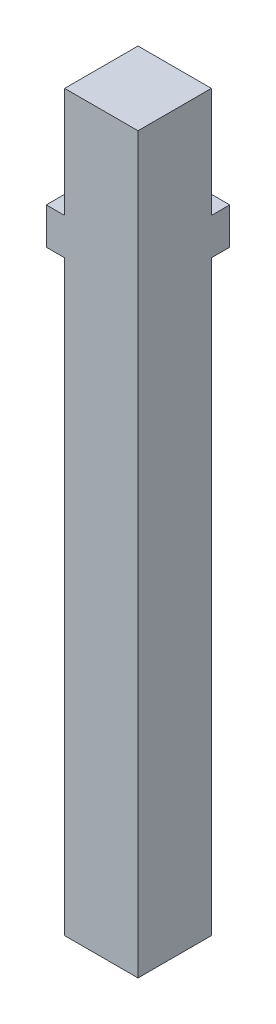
ISO-10303-21;
HEADER;
FILE_DESCRIPTION(('STEP AP214'),'2;1');
FILE_NAME('part.step','',(''),(''),'','','');
FILE_SCHEMA(('AUTOMOTIVE_DESIGN { 1 0 10303 214 1 1 1 1 }'));
ENDSEC;
DATA;
#1=APPLICATION_CONTEXT('core data for automotive mechanical design processes');
#2=APPLICATION_PROTOCOL_DEFINITION('international standard','automotive_design',2000,#1);
#3=PRODUCT_CONTEXT('',#1,'mechanical');
#4=PRODUCT('Part','Part','',(#3));
#5=PRODUCT_RELATED_PRODUCT_CATEGORY('part','',(#4));
#6=PRODUCT_DEFINITION_FORMATION('','',#4);
#7=PRODUCT_DEFINITION_CONTEXT('part definition',#1,'design');
#8=PRODUCT_DEFINITION('design','',#6,#7);
#9=PRODUCT_DEFINITION_SHAPE('','',#8);
#10=(LENGTH_UNIT() NAMED_UNIT(*) SI_UNIT(.MILLI.,.METRE.));
#11=(NAMED_UNIT(*) PLANE_ANGLE_UNIT() SI_UNIT($,.RADIAN.));
#12=(NAMED_UNIT(*) SI_UNIT($,.STERADIAN.) SOLID_ANGLE_UNIT());
#13=UNCERTAINTY_MEASURE_WITH_UNIT(LENGTH_MEASURE(1.E-05),#10,'distance_accuracy_value','');
#14=(GEOMETRIC_REPRESENTATION_CONTEXT(3) GLOBAL_UNCERTAINTY_ASSIGNED_CONTEXT((#13)) GLOBAL_UNIT_ASSIGNED_CONTEXT((#10,
#11,#12)) REPRESENTATION_CONTEXT('',''));
#15=CARTESIAN_POINT('',(0.,0.,0.));
#16=DIRECTION('',(0.,0.,1.));
#17=DIRECTION('',(1.,0.,0.));
#18=AXIS2_PLACEMENT_3D('',#15,#16,#17);
#19=CARTESIAN_POINT('',(0.,254.,0.));
#20=DIRECTION('',(1.,0.,0.));
#21=DIRECTION('',(0.,0.,-1.));
#22=AXIS2_PLACEMENT_3D('',#19,#20,#21);
#23=PLANE('',#22);
#24=DIRECTION('',(0.,0.,-1.));
#25=VECTOR('',#24,1.);
#26=CARTESIAN_POINT('',(0.,215.9,0.));
#27=LINE('',#26,#25);
#28=CARTESIAN_POINT('',(0.,215.9,0.));
#29=VERTEX_POINT('',#28);
#30=CARTESIAN_POINT('',(0.,215.9,-25.4));
#31=VERTEX_POINT('',#30);
#32=EDGE_CURVE('E166',#29,#31,#27,.T.);
#33=ORIENTED_EDGE('',*,*,#32,.F.);
#34=DIRECTION('',(0.,-1.,0.));
#35=VECTOR('',#34,1.);
#36=CARTESIAN_POINT('',(0.,254.,0.));
#37=LINE('',#36,#35);
#38=CARTESIAN_POINT('',(0.,254.,0.));
#39=VERTEX_POINT('',#38);
#40=EDGE_CURVE('E140',#39,#29,#37,.T.);
#41=ORIENTED_EDGE('',*,*,#40,.F.);
#42=DIRECTION('',(0.,0.,1.));
#43=VECTOR('',#42,1.);
#44=CARTESIAN_POINT('',(0.,254.,0.));
#45=LINE('',#44,#43);
#46=CARTESIAN_POINT('',(0.,254.,-25.4));
#47=VERTEX_POINT('',#46);
#48=EDGE_CURVE('E176',#47,#39,#45,.T.);
#49=ORIENTED_EDGE('',*,*,#48,.F.);
#50=DIRECTION('',(0.,-1.,0.));
#51=VECTOR('',#50,1.);
#52=CARTESIAN_POINT('',(0.,254.,-25.4));
#53=LINE('',#52,#51);
#54=EDGE_CURVE('E198',#47,#31,#53,.T.);
#55=ORIENTED_EDGE('',*,*,#54,.T.);
#56=EDGE_LOOP('',(#33,#41,#49,#55));
#57=FACE_BOUND('',#56,.T.);
#58=ADVANCED_FACE('F45',(#57),#23,.F.);
#59=CARTESIAN_POINT('',(0.,254.,-25.4));
#60=DIRECTION('',(0.,0.,1.));
#61=DIRECTION('',(1.,0.,0.));
#62=AXIS2_PLACEMENT_3D('',#59,#60,#61);
#63=PLANE('',#62);
#64=DIRECTION('',(1.,0.,0.));
#65=VECTOR('',#64,1.);
#66=CARTESIAN_POINT('',(0.,215.9,-25.4));
#67=LINE('',#66,#65);
#68=CARTESIAN_POINT('',(25.4,215.9,-25.4));
#69=VERTEX_POINT('',#68);
#70=EDGE_CURVE('E11',#31,#69,#67,.T.);
#71=ORIENTED_EDGE('',*,*,#70,.F.);
#72=ORIENTED_EDGE('',*,*,#54,.F.);
#73=DIRECTION('',(-1.,0.,0.));
#74=VECTOR('',#73,1.);
#75=CARTESIAN_POINT('',(0.,254.,-25.4));
#76=LINE('',#75,#74);
#77=CARTESIAN_POINT('',(25.4,254.,-25.4));
#78=VERTEX_POINT('',#77);
#79=EDGE_CURVE('E70',#78,#47,#76,.T.);
#80=ORIENTED_EDGE('',*,*,#79,.F.);
#81=DIRECTION('',(0.,-1.,0.));
#82=VECTOR('',#81,1.);
#83=CARTESIAN_POINT('',(25.4,254.,-25.4));
#84=LINE('',#83,#82);
#85=EDGE_CURVE('E203',#78,#69,#84,.T.);
#86=ORIENTED_EDGE('',*,*,#85,.T.);
#87=EDGE_LOOP('',(#71,#72,#80,#86));
#88=FACE_BOUND('',#87,.T.);
#89=ADVANCED_FACE('F231',(#88),#63,.F.);
#90=CARTESIAN_POINT('',(0.,203.2,0.));
#91=VERTEX_POINT('',#90);
#92=CARTESIAN_POINT('',(0.,0.,0.));
#93=VERTEX_POINT('',#92);
#94=EDGE_CURVE('E210',#91,#93,#37,.T.);
#95=ORIENTED_EDGE('',*,*,#94,.F.);
#96=DIRECTION('',(0.,0.,-1.));
#97=VECTOR('',#96,1.);
#98=CARTESIAN_POINT('',(0.,203.2,0.));
#99=LINE('',#98,#97);
#100=CARTESIAN_POINT('',(0.,203.2,-25.4));
#101=VERTEX_POINT('',#100);
#102=EDGE_CURVE('E161',#91,#101,#99,.T.);
#103=ORIENTED_EDGE('',*,*,#102,.T.);
#104=CARTESIAN_POINT('',(0.,0.,-25.4));
#105=VERTEX_POINT('',#104);
#106=EDGE_CURVE('E92',#101,#105,#53,.T.);
#107=ORIENTED_EDGE('',*,*,#106,.T.);
#108=DIRECTION('',(0.,0.,1.));
#109=VECTOR('',#108,1.);
#110=CARTESIAN_POINT('',(0.,0.,0.));
#111=LINE('',#110,#109);
#112=EDGE_CURVE('E175',#105,#93,#111,.T.);
#113=ORIENTED_EDGE('',*,*,#112,.T.);
#114=EDGE_LOOP('',(#95,#103,#107,#113));
#115=FACE_BOUND('',#114,.T.);
#116=ADVANCED_FACE('F47',(#115),#23,.F.);
#117=CARTESIAN_POINT('',(0.,254.,0.));
#118=DIRECTION('',(0.,0.,-1.));
#119=DIRECTION('',(-1.,0.,0.));
#120=AXIS2_PLACEMENT_3D('',#117,#118,#119);
#121=PLANE('',#120);
#122=DIRECTION('',(1.,0.,0.));
#123=VECTOR('',#122,1.);
#124=CARTESIAN_POINT('',(0.,0.,0.));
#125=LINE('',#124,#123);
#126=CARTESIAN_POINT('',(25.4,0.,0.));
#127=VERTEX_POINT('',#126);
#128=EDGE_CURVE('E189',#93,#127,#125,.T.);
#129=ORIENTED_EDGE('',*,*,#128,.T.);
#130=DIRECTION('',(0.,-1.,0.));
#131=VECTOR('',#130,1.);
#132=CARTESIAN_POINT('',(25.4,254.,0.));
#133=LINE('',#132,#131);
#134=CARTESIAN_POINT('',(25.4,254.,0.));
#135=VERTEX_POINT('',#134);
#136=EDGE_CURVE('E207',#135,#127,#133,.T.);
#137=ORIENTED_EDGE('',*,*,#136,.F.);
#138=DIRECTION('',(1.,0.,0.));
#139=VECTOR('',#138,1.);
#140=CARTESIAN_POINT('',(0.,254.,0.));
#141=LINE('',#140,#139);
#142=EDGE_CURVE('E100',#39,#135,#141,.T.);
#143=ORIENTED_EDGE('',*,*,#142,.F.);
#144=ORIENTED_EDGE('',*,*,#40,.T.);
#145=DIRECTION('',(1.,0.,0.));
#146=VECTOR('',#145,1.);
#147=CARTESIAN_POINT('',(-6.35,215.9,0.));
#148=LINE('',#147,#146);
#149=CARTESIAN_POINT('',(-6.35,215.9,0.));
#150=VERTEX_POINT('',#149);
#151=EDGE_CURVE('E131',#150,#29,#148,.T.);
#152=ORIENTED_EDGE('',*,*,#151,.F.);
#153=DIRECTION('',(0.,-1.,0.));
#154=VECTOR('',#153,1.);
#155=CARTESIAN_POINT('',(-6.35,215.9,0.));
#156=LINE('',#155,#154);
#157=CARTESIAN_POINT('',(-6.35,203.2,0.));
#158=VERTEX_POINT('',#157);
#159=EDGE_CURVE('E137',#150,#158,#156,.T.);
#160=ORIENTED_EDGE('',*,*,#159,.T.);
#161=DIRECTION('',(1.,0.,0.));
#162=VECTOR('',#161,1.);
#163=CARTESIAN_POINT('',(-6.35,203.2,0.));
#164=LINE('',#163,#162);
#165=EDGE_CURVE('E226',#158,#91,#164,.T.);
#166=ORIENTED_EDGE('',*,*,#165,.T.);
#167=ORIENTED_EDGE('',*,*,#94,.T.);
#168=EDGE_LOOP('',(#129,#137,#143,#144,#152,#160,#166,#167));
#169=FACE_BOUND('',#168,.T.);
#170=ADVANCED_FACE('F134',(#169),#121,.F.);
#171=CARTESIAN_POINT('',(25.4,254.,0.));
#172=DIRECTION('',(-1.,0.,0.));
#173=DIRECTION('',(0.,0.,1.));
#174=AXIS2_PLACEMENT_3D('',#171,#172,#173);
#175=PLANE('',#174);
#176=CARTESIAN_POINT('',(25.4,203.2,-25.4));
#177=VERTEX_POINT('',#176);
#178=CARTESIAN_POINT('',(25.4,0.,-25.4));
#179=VERTEX_POINT('',#178);
#180=EDGE_CURVE('E202',#177,#179,#84,.T.);
#181=ORIENTED_EDGE('',*,*,#180,.F.);
#182=DIRECTION('',(0.,0.,-1.));
#183=VECTOR('',#182,1.);
#184=CARTESIAN_POINT('',(25.4,203.2,0.));
#185=LINE('',#184,#183);
#186=CARTESIAN_POINT('',(25.4,203.2,-31.75));
#187=VERTEX_POINT('',#186);
#188=EDGE_CURVE('E61',#177,#187,#185,.T.);
#189=ORIENTED_EDGE('',*,*,#188,.T.);
#190=DIRECTION('',(0.,-1.,0.));
#191=VECTOR('',#190,1.);
#192=CARTESIAN_POINT('',(25.4,215.9,-31.75));
#193=LINE('',#192,#191);
#194=CARTESIAN_POINT('',(25.4,215.9,-31.75));
#195=VERTEX_POINT('',#194);
#196=EDGE_CURVE('E162',#195,#187,#193,.T.);
#197=ORIENTED_EDGE('',*,*,#196,.F.);
#198=DIRECTION('',(0.,0.,-1.));
#199=VECTOR('',#198,1.);
#200=CARTESIAN_POINT('',(25.4,215.9,0.));
#201=LINE('',#200,#199);
#202=EDGE_CURVE('E144',#69,#195,#201,.T.);
#203=ORIENTED_EDGE('',*,*,#202,.F.);
#204=ORIENTED_EDGE('',*,*,#85,.F.);
#205=DIRECTION('',(0.,0.,-1.));
#206=VECTOR('',#205,1.);
#207=CARTESIAN_POINT('',(25.4,254.,0.));
#208=LINE('',#207,#206);
#209=EDGE_CURVE('E182',#135,#78,#208,.T.);
#210=ORIENTED_EDGE('',*,*,#209,.F.);
#211=ORIENTED_EDGE('',*,*,#136,.T.);
#212=DIRECTION('',(0.,0.,-1.));
#213=VECTOR('',#212,1.);
#214=CARTESIAN_POINT('',(25.4,0.,0.));
#215=LINE('',#214,#213);
#216=EDGE_CURVE('E192',#127,#179,#215,.T.);
#217=ORIENTED_EDGE('',*,*,#216,.T.);
#218=EDGE_LOOP('',(#181,#189,#197,#203,#204,#210,#211,#217));
#219=FACE_BOUND('',#218,.T.);
#220=ADVANCED_FACE('F217',(#219),#175,.F.);
#221=ORIENTED_EDGE('',*,*,#106,.F.);
#222=DIRECTION('',(1.,0.,0.));
#223=VECTOR('',#222,1.);
#224=CARTESIAN_POINT('',(0.,203.2,-25.4));
#225=LINE('',#224,#223);
#226=EDGE_CURVE('E54',#101,#177,#225,.T.);
#227=ORIENTED_EDGE('',*,*,#226,.T.);
#228=ORIENTED_EDGE('',*,*,#180,.T.);
#229=DIRECTION('',(-1.,0.,0.));
#230=VECTOR('',#229,1.);
#231=CARTESIAN_POINT('',(0.,0.,-25.4));
#232=LINE('',#231,#230);
#233=EDGE_CURVE('E179',#179,#105,#232,.T.);
#234=ORIENTED_EDGE('',*,*,#233,.T.);
#235=EDGE_LOOP('',(#221,#227,#228,#234));
#236=FACE_BOUND('',#235,.T.);
#237=ADVANCED_FACE('F215',(#236),#63,.F.);
#238=CARTESIAN_POINT('',(0.,254.,0.));
#239=DIRECTION('',(0.,-1.,0.));
#240=DIRECTION('',(0.,0.,-1.));
#241=AXIS2_PLACEMENT_3D('',#238,#239,#240);
#242=PLANE('',#241);
#243=ORIENTED_EDGE('',*,*,#48,.T.);
#244=ORIENTED_EDGE('',*,*,#142,.T.);
#245=ORIENTED_EDGE('',*,*,#209,.T.);
#246=ORIENTED_EDGE('',*,*,#79,.T.);
#247=EDGE_LOOP('',(#243,#244,#245,#246));
#248=FACE_BOUND('',#247,.T.);
#249=ADVANCED_FACE('F273',(#248),#242,.F.);
#250=CARTESIAN_POINT('',(0.,0.,0.));
#251=DIRECTION('',(0.,-1.,0.));
#252=DIRECTION('',(0.,0.,-1.));
#253=AXIS2_PLACEMENT_3D('',#250,#251,#252);
#254=PLANE('',#253);
#255=ORIENTED_EDGE('',*,*,#112,.F.);
#256=ORIENTED_EDGE('',*,*,#233,.F.);
#257=ORIENTED_EDGE('',*,*,#216,.F.);
#258=ORIENTED_EDGE('',*,*,#128,.F.);
#259=EDGE_LOOP('',(#255,#256,#257,#258));
#260=FACE_BOUND('',#259,.T.);
#261=ADVANCED_FACE('F229',(#260),#254,.T.);
#262=CARTESIAN_POINT('',(0.,215.9,0.));
#263=DIRECTION('',(0.,-1.,0.));
#264=DIRECTION('',(0.,0.,-1.));
#265=AXIS2_PLACEMENT_3D('',#262,#263,#264);
#266=PLANE('',#265);
#267=ORIENTED_EDGE('',*,*,#151,.T.);
#268=ORIENTED_EDGE('',*,*,#32,.T.);
#269=ORIENTED_EDGE('',*,*,#70,.T.);
#270=ORIENTED_EDGE('',*,*,#202,.T.);
#271=DIRECTION('',(-1.,0.,0.));
#272=VECTOR('',#271,1.);
#273=CARTESIAN_POINT('',(-6.35,215.9,-31.75));
#274=LINE('',#273,#272);
#275=CARTESIAN_POINT('',(-6.35,215.9,-31.75));
#276=VERTEX_POINT('',#275);
#277=EDGE_CURVE('E150',#195,#276,#274,.T.);
#278=ORIENTED_EDGE('',*,*,#277,.T.);
#279=DIRECTION('',(0.,0.,1.));
#280=VECTOR('',#279,1.);
#281=CARTESIAN_POINT('',(-6.35,215.9,0.));
#282=LINE('',#281,#280);
#283=EDGE_CURVE('E145',#276,#150,#282,.T.);
#284=ORIENTED_EDGE('',*,*,#283,.T.);
#285=EDGE_LOOP('',(#267,#268,#269,#270,#278,#284));
#286=FACE_BOUND('',#285,.T.);
#287=ADVANCED_FACE('F148',(#286),#266,.F.);
#288=CARTESIAN_POINT('',(0.,203.2,0.));
#289=DIRECTION('',(0.,-1.,0.));
#290=DIRECTION('',(0.,0.,-1.));
#291=AXIS2_PLACEMENT_3D('',#288,#289,#290);
#292=PLANE('',#291);
#293=ORIENTED_EDGE('',*,*,#102,.F.);
#294=ORIENTED_EDGE('',*,*,#165,.F.);
#295=DIRECTION('',(0.,0.,1.));
#296=VECTOR('',#295,1.);
#297=CARTESIAN_POINT('',(-6.35,203.2,0.));
#298=LINE('',#297,#296);
#299=CARTESIAN_POINT('',(-6.35,203.2,-31.75));
#300=VERTEX_POINT('',#299);
#301=EDGE_CURVE('E159',#300,#158,#298,.T.);
#302=ORIENTED_EDGE('',*,*,#301,.F.);
#303=DIRECTION('',(-1.,0.,0.));
#304=VECTOR('',#303,1.);
#305=CARTESIAN_POINT('',(-6.35,203.2,-31.75));
#306=LINE('',#305,#304);
#307=EDGE_CURVE('E155',#187,#300,#306,.T.);
#308=ORIENTED_EDGE('',*,*,#307,.F.);
#309=ORIENTED_EDGE('',*,*,#188,.F.);
#310=ORIENTED_EDGE('',*,*,#226,.F.);
#311=EDGE_LOOP('',(#293,#294,#302,#308,#309,#310));
#312=FACE_BOUND('',#311,.T.);
#313=ADVANCED_FACE('F262',(#312),#292,.T.);
#314=CARTESIAN_POINT('',(-6.35,215.9,0.));
#315=DIRECTION('',(1.,0.,0.));
#316=DIRECTION('',(0.,0.,-1.));
#317=AXIS2_PLACEMENT_3D('',#314,#315,#316);
#318=PLANE('',#317);
#319=ORIENTED_EDGE('',*,*,#301,.T.);
#320=ORIENTED_EDGE('',*,*,#159,.F.);
#321=ORIENTED_EDGE('',*,*,#283,.F.);
#322=DIRECTION('',(0.,-1.,0.));
#323=VECTOR('',#322,1.);
#324=CARTESIAN_POINT('',(-6.35,215.9,-31.75));
#325=LINE('',#324,#323);
#326=EDGE_CURVE('E169',#276,#300,#325,.T.);
#327=ORIENTED_EDGE('',*,*,#326,.T.);
#328=EDGE_LOOP('',(#319,#320,#321,#327));
#329=FACE_BOUND('',#328,.T.);
#330=ADVANCED_FACE('F157',(#329),#318,.F.);
#331=CARTESIAN_POINT('',(-6.35,215.9,-31.75));
#332=DIRECTION('',(0.,0.,1.));
#333=DIRECTION('',(1.,0.,0.));
#334=AXIS2_PLACEMENT_3D('',#331,#332,#333);
#335=PLANE('',#334);
#336=ORIENTED_EDGE('',*,*,#307,.T.);
#337=ORIENTED_EDGE('',*,*,#326,.F.);
#338=ORIENTED_EDGE('',*,*,#277,.F.);
#339=ORIENTED_EDGE('',*,*,#196,.T.);
#340=EDGE_LOOP('',(#336,#337,#338,#339));
#341=FACE_BOUND('',#340,.T.);
#342=ADVANCED_FACE('F263',(#341),#335,.F.);
#343=CLOSED_SHELL('',(#58,#89,#116,#170,#220,#237,#249,#261,#287,#313,#330,#342));
#344=MANIFOLD_SOLID_BREP('B2',#343);
#345=ADVANCED_BREP_SHAPE_REPRESENTATION('',(#18,#344),#14);
#346=SHAPE_DEFINITION_REPRESENTATION(#9,#345);
ENDSEC;
END-ISO-10303-21;
